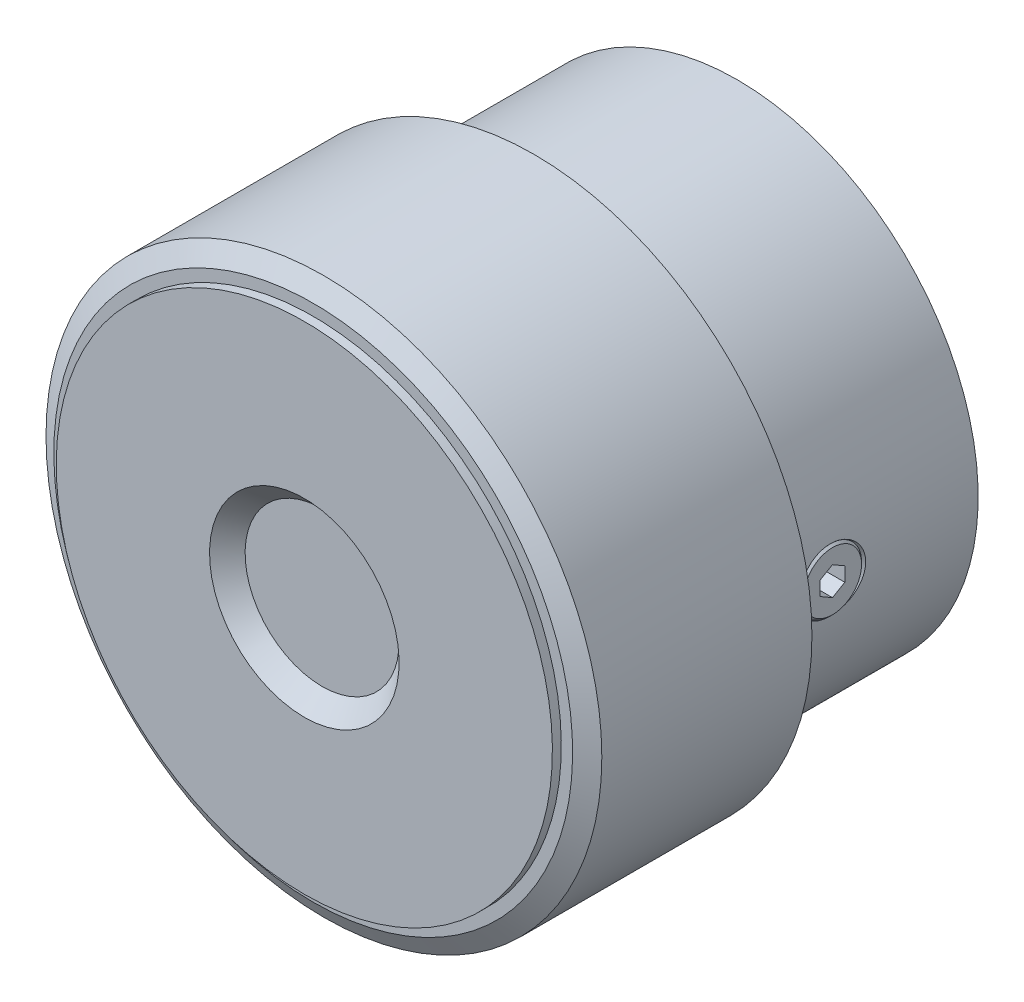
ISO-10303-21;
HEADER;
FILE_DESCRIPTION(('STEP AP214'),'2;1');
FILE_NAME('part.step','',(''),(''),'','','');
FILE_SCHEMA(('AUTOMOTIVE_DESIGN { 1 0 10303 214 1 1 1 1 }'));
ENDSEC;
DATA;
#1=APPLICATION_CONTEXT('core data for automotive mechanical design processes');
#2=APPLICATION_PROTOCOL_DEFINITION('international standard','automotive_design',2000,#1);
#3=PRODUCT_CONTEXT('',#1,'mechanical');
#4=PRODUCT('Part','Part','',(#3));
#5=PRODUCT_RELATED_PRODUCT_CATEGORY('part','',(#4));
#6=PRODUCT_DEFINITION_FORMATION('','',#4);
#7=PRODUCT_DEFINITION_CONTEXT('part definition',#1,'design');
#8=PRODUCT_DEFINITION('design','',#6,#7);
#9=PRODUCT_DEFINITION_SHAPE('','',#8);
#10=(LENGTH_UNIT() NAMED_UNIT(*) SI_UNIT(.MILLI.,.METRE.));
#11=(NAMED_UNIT(*) PLANE_ANGLE_UNIT() SI_UNIT($,.RADIAN.));
#12=(NAMED_UNIT(*) SI_UNIT($,.STERADIAN.) SOLID_ANGLE_UNIT());
#13=UNCERTAINTY_MEASURE_WITH_UNIT(LENGTH_MEASURE(1.E-05),#10,'distance_accuracy_value','');
#14=(GEOMETRIC_REPRESENTATION_CONTEXT(3) GLOBAL_UNCERTAINTY_ASSIGNED_CONTEXT((#13)) GLOBAL_UNIT_ASSIGNED_CONTEXT((#10,
#11,#12)) REPRESENTATION_CONTEXT('',''));
#15=CARTESIAN_POINT('',(0.,0.,0.));
#16=DIRECTION('',(0.,0.,1.));
#17=DIRECTION('',(1.,0.,0.));
#18=AXIS2_PLACEMENT_3D('',#15,#16,#17);
#19=CARTESIAN_POINT('',(0.,0.,13.4433756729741));
#20=DIRECTION('',(0.,0.,1.));
#21=DIRECTION('',(0.,-1.,0.));
#22=AXIS2_PLACEMENT_3D('',#19,#20,#21);
#23=CYLINDRICAL_SURFACE('',#22,2.5);
#24=CARTESIAN_POINT('',(0.,0.,12.));
#25=DIRECTION('',(0.,0.,-1.));
#26=DIRECTION('',(0.,1.,0.));
#27=AXIS2_PLACEMENT_3D('',#24,#25,#26);
#28=CIRCLE('',#27,2.5);
#29=CARTESIAN_POINT('',(0.,2.5,12.));
#30=VERTEX_POINT('',#29);
#31=EDGE_CURVE('E90',#30,#30,#28,.T.);
#32=ORIENTED_EDGE('',*,*,#31,.F.);
#33=EDGE_LOOP('',(#32));
#34=FACE_BOUND('',#33,.T.);
#35=CARTESIAN_POINT('',(0.,0.,0.2));
#36=DIRECTION('',(0.,0.,1.));
#37=DIRECTION('',(0.,-1.,0.));
#38=AXIS2_PLACEMENT_3D('',#35,#36,#37);
#39=CIRCLE('',#38,2.5);
#40=CARTESIAN_POINT('',(0.,-2.5,0.2));
#41=VERTEX_POINT('',#40);
#42=EDGE_CURVE('E137',#41,#41,#39,.T.);
#43=ORIENTED_EDGE('',*,*,#42,.F.);
#44=EDGE_LOOP('',(#43));
#45=FACE_BOUND('',#44,.T.);
#46=ADVANCED_FACE('F14',(#34,#45),#23,.F.);
#47=CARTESIAN_POINT('',(0.,0.,0.));
#48=DIRECTION('',(0.,0.,-1.));
#49=DIRECTION('',(0.,1.,0.));
#50=AXIS2_PLACEMENT_3D('',#47,#48,#49);
#51=CONICAL_SURFACE('',#50,2.7,0.785398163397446);
#52=ORIENTED_EDGE('',*,*,#42,.T.);
#53=EDGE_LOOP('',(#52));
#54=FACE_BOUND('',#53,.T.);
#55=CARTESIAN_POINT('',(0.,0.,0.));
#56=DIRECTION('',(0.,0.,1.));
#57=DIRECTION('',(0.,-1.,0.));
#58=AXIS2_PLACEMENT_3D('',#55,#56,#57);
#59=CIRCLE('',#58,2.7);
#60=CARTESIAN_POINT('',(0.,-2.7,0.));
#61=VERTEX_POINT('',#60);
#62=EDGE_CURVE('E140',#61,#61,#59,.T.);
#63=ORIENTED_EDGE('',*,*,#62,.F.);
#64=EDGE_LOOP('',(#63));
#65=FACE_BOUND('',#64,.T.);
#66=ADVANCED_FACE('F164',(#54,#65),#51,.F.);
#67=CARTESIAN_POINT('',(0.,0.,0.));
#68=DIRECTION('',(0.,0.,1.));
#69=DIRECTION('',(0.,-1.,0.));
#70=AXIS2_PLACEMENT_3D('',#67,#68,#69);
#71=PLANE('',#70);
#72=CARTESIAN_POINT('',(0.,0.,0.));
#73=DIRECTION('',(0.,0.,1.));
#74=DIRECTION('',(0.,-1.,0.));
#75=AXIS2_PLACEMENT_3D('',#72,#73,#74);
#76=CIRCLE('',#75,5.5);
#77=CARTESIAN_POINT('',(0.,-5.5,0.));
#78=VERTEX_POINT('',#77);
#79=EDGE_CURVE('E23',#78,#78,#76,.T.);
#80=ORIENTED_EDGE('',*,*,#79,.F.);
#81=EDGE_LOOP('',(#80));
#82=FACE_BOUND('',#81,.T.);
#83=ORIENTED_EDGE('',*,*,#62,.T.);
#84=EDGE_LOOP('',(#83));
#85=FACE_BOUND('',#84,.T.);
#86=ADVANCED_FACE('F215',(#82,#85),#71,.F.);
#87=CARTESIAN_POINT('',(11.,0.,8.5));
#88=DIRECTION('',(1.,0.,0.));
#89=DIRECTION('',(0.,1.,0.));
#90=AXIS2_PLACEMENT_3D('',#87,#88,#89);
#91=PLANE('',#90);
#92=DIRECTION('',(0.,1.,0.));
#93=VECTOR('',#92,1.);
#94=CARTESIAN_POINT('',(11.,-0.384900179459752,7.83333333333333));
#95=LINE('',#94,#93);
#96=CARTESIAN_POINT('',(11.,-0.384900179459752,7.83333333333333));
#97=VERTEX_POINT('',#96);
#98=CARTESIAN_POINT('',(11.,0.384900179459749,7.83333333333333));
#99=VERTEX_POINT('',#98);
#100=EDGE_CURVE('E71',#97,#99,#95,.T.);
#101=ORIENTED_EDGE('',*,*,#100,.T.);
#102=DIRECTION('',(0.,0.5,0.866025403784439));
#103=VECTOR('',#102,1.);
#104=CARTESIAN_POINT('',(11.,0.384900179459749,7.83333333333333));
#105=LINE('',#104,#103);
#106=CARTESIAN_POINT('',(11.,0.7698003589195,8.5));
#107=VERTEX_POINT('',#106);
#108=EDGE_CURVE('E78',#99,#107,#105,.T.);
#109=ORIENTED_EDGE('',*,*,#108,.T.);
#110=DIRECTION('',(0.,-0.5,0.866025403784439));
#111=VECTOR('',#110,1.);
#112=CARTESIAN_POINT('',(11.,0.7698003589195,8.5));
#113=LINE('',#112,#111);
#114=CARTESIAN_POINT('',(11.,0.384900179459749,9.16666666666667));
#115=VERTEX_POINT('',#114);
#116=EDGE_CURVE('E84',#107,#115,#113,.T.);
#117=ORIENTED_EDGE('',*,*,#116,.T.);
#118=DIRECTION('',(0.,-1.,0.));
#119=VECTOR('',#118,1.);
#120=CARTESIAN_POINT('',(11.,0.384900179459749,9.16666666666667));
#121=LINE('',#120,#119);
#122=CARTESIAN_POINT('',(11.,-0.384900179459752,9.16666666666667));
#123=VERTEX_POINT('',#122);
#124=EDGE_CURVE('E97',#115,#123,#121,.T.);
#125=ORIENTED_EDGE('',*,*,#124,.T.);
#126=DIRECTION('',(0.,-0.5,-0.866025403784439));
#127=VECTOR('',#126,1.);
#128=CARTESIAN_POINT('',(11.,-0.384900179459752,9.16666666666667));
#129=LINE('',#128,#127);
#130=CARTESIAN_POINT('',(11.,-0.769800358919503,8.5));
#131=VERTEX_POINT('',#130);
#132=EDGE_CURVE('E100',#123,#131,#129,.T.);
#133=ORIENTED_EDGE('',*,*,#132,.T.);
#134=DIRECTION('',(0.,0.5,-0.866025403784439));
#135=VECTOR('',#134,1.);
#136=CARTESIAN_POINT('',(11.,-0.769800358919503,8.5));
#137=LINE('',#136,#135);
#138=EDGE_CURVE('E89',#131,#97,#137,.T.);
#139=ORIENTED_EDGE('',*,*,#138,.T.);
#140=EDGE_LOOP('',(#101,#109,#117,#125,#133,#139));
#141=FACE_BOUND('',#140,.T.);
#142=ADVANCED_FACE('F87',(#141),#91,.T.);
#143=CARTESIAN_POINT('',(0.,0.,24.));
#144=DIRECTION('',(0.,0.,1.));
#145=DIRECTION('',(0.,-1.,0.));
#146=AXIS2_PLACEMENT_3D('',#143,#144,#145);
#147=CYLINDRICAL_SURFACE('',#146,5.5);
#148=CARTESIAN_POINT('',(0.,0.,0.3));
#149=DIRECTION('',(0.,0.,1.));
#150=DIRECTION('',(0.,-1.,0.));
#151=AXIS2_PLACEMENT_3D('',#148,#149,#150);
#152=CIRCLE('',#151,5.5);
#153=CARTESIAN_POINT('',(0.,-5.5,0.3));
#154=VERTEX_POINT('',#153);
#155=EDGE_CURVE('E508',#154,#154,#152,.T.);
#156=ORIENTED_EDGE('',*,*,#155,.F.);
#157=EDGE_LOOP('',(#156));
#158=FACE_BOUND('',#157,.T.);
#159=ORIENTED_EDGE('',*,*,#79,.T.);
#160=EDGE_LOOP('',(#159));
#161=FACE_BOUND('',#160,.T.);
#162=ADVANCED_FACE('F211',(#158,#161),#147,.T.);
#163=CARTESIAN_POINT('',(15.,0.384900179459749,7.83333333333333));
#164=DIRECTION('',(0.,-0.866025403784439,0.5));
#165=DIRECTION('',(0.,-0.5,-0.866025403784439));
#166=AXIS2_PLACEMENT_3D('',#163,#164,#165);
#167=PLANE('',#166);
#168=DIRECTION('',(0.,0.5,0.866025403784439));
#169=VECTOR('',#168,1.);
#170=CARTESIAN_POINT('',(13.005652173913,0.577350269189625,8.16666666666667));
#171=LINE('',#170,#169);
#172=CARTESIAN_POINT('',(13.005652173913,0.384900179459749,7.83333333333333));
#173=VERTEX_POINT('',#172);
#174=CARTESIAN_POINT('',(13.005652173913,0.7698003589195,8.5));
#175=VERTEX_POINT('',#174);
#176=EDGE_CURVE('E121',#173,#175,#171,.T.);
#177=ORIENTED_EDGE('',*,*,#176,.T.);
#178=DIRECTION('',(-1.,0.,0.));
#179=VECTOR('',#178,1.);
#180=CARTESIAN_POINT('',(15.,0.7698003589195,8.5));
#181=LINE('',#180,#179);
#182=EDGE_CURVE('E75',#175,#107,#181,.T.);
#183=ORIENTED_EDGE('',*,*,#182,.T.);
#184=ORIENTED_EDGE('',*,*,#108,.F.);
#185=DIRECTION('',(-1.,0.,0.));
#186=VECTOR('',#185,1.);
#187=CARTESIAN_POINT('',(15.,0.384900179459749,7.83333333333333));
#188=LINE('',#187,#186);
#189=EDGE_CURVE('E67',#173,#99,#188,.T.);
#190=ORIENTED_EDGE('',*,*,#189,.F.);
#191=EDGE_LOOP('',(#177,#183,#184,#190));
#192=FACE_BOUND('',#191,.T.);
#193=ADVANCED_FACE('F79',(#192),#167,.T.);
#194=CARTESIAN_POINT('',(15.,0.7698003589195,8.5));
#195=DIRECTION('',(0.,-0.866025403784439,-0.5));
#196=DIRECTION('',(0.,0.5,-0.866025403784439));
#197=AXIS2_PLACEMENT_3D('',#194,#195,#196);
#198=PLANE('',#197);
#199=DIRECTION('',(0.,-0.5,0.866025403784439));
#200=VECTOR('',#199,1.);
#201=CARTESIAN_POINT('',(13.005652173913,0.577350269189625,8.83333333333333));
#202=LINE('',#201,#200);
#203=CARTESIAN_POINT('',(13.005652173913,0.384900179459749,9.16666666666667));
#204=VERTEX_POINT('',#203);
#205=EDGE_CURVE('E119',#175,#204,#202,.T.);
#206=ORIENTED_EDGE('',*,*,#205,.T.);
#207=DIRECTION('',(-1.,0.,0.));
#208=VECTOR('',#207,1.);
#209=CARTESIAN_POINT('',(15.,0.384900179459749,9.16666666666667));
#210=LINE('',#209,#208);
#211=EDGE_CURVE('E108',#204,#115,#210,.T.);
#212=ORIENTED_EDGE('',*,*,#211,.T.);
#213=ORIENTED_EDGE('',*,*,#116,.F.);
#214=ORIENTED_EDGE('',*,*,#182,.F.);
#215=EDGE_LOOP('',(#206,#212,#213,#214));
#216=FACE_BOUND('',#215,.T.);
#217=ADVANCED_FACE('F220',(#216),#198,.T.);
#218=CARTESIAN_POINT('',(15.,0.384900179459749,9.16666666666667));
#219=DIRECTION('',(0.,0.,-1.));
#220=DIRECTION('',(0.,1.,0.));
#221=AXIS2_PLACEMENT_3D('',#218,#219,#220);
#222=PLANE('',#221);
#223=ORIENTED_EDGE('',*,*,#211,.F.);
#224=DIRECTION('',(0.,-1.,0.));
#225=VECTOR('',#224,1.);
#226=CARTESIAN_POINT('',(13.005652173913,0.,9.16666666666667));
#227=LINE('',#226,#225);
#228=CARTESIAN_POINT('',(13.005652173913,-0.384900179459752,9.16666666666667));
#229=VERTEX_POINT('',#228);
#230=EDGE_CURVE('E117',#204,#229,#227,.T.);
#231=ORIENTED_EDGE('',*,*,#230,.T.);
#232=DIRECTION('',(-1.,0.,0.));
#233=VECTOR('',#232,1.);
#234=CARTESIAN_POINT('',(15.,-0.384900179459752,9.16666666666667));
#235=LINE('',#234,#233);
#236=EDGE_CURVE('E106',#229,#123,#235,.T.);
#237=ORIENTED_EDGE('',*,*,#236,.T.);
#238=ORIENTED_EDGE('',*,*,#124,.F.);
#239=EDGE_LOOP('',(#223,#231,#237,#238));
#240=FACE_BOUND('',#239,.T.);
#241=ADVANCED_FACE('F242',(#240),#222,.T.);
#242=CARTESIAN_POINT('',(15.,-0.384900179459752,9.16666666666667));
#243=DIRECTION('',(0.,0.866025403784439,-0.5));
#244=DIRECTION('',(0.,0.5,0.866025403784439));
#245=AXIS2_PLACEMENT_3D('',#242,#243,#244);
#246=PLANE('',#245);
#247=DIRECTION('',(0.,-0.5,-0.866025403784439));
#248=VECTOR('',#247,1.);
#249=CARTESIAN_POINT('',(13.005652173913,-0.577350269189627,8.83333333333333));
#250=LINE('',#249,#248);
#251=CARTESIAN_POINT('',(13.005652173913,-0.769800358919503,8.5));
#252=VERTEX_POINT('',#251);
#253=EDGE_CURVE('E115',#229,#252,#250,.T.);
#254=ORIENTED_EDGE('',*,*,#253,.T.);
#255=DIRECTION('',(-1.,0.,0.));
#256=VECTOR('',#255,1.);
#257=CARTESIAN_POINT('',(15.,-0.769800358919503,8.5));
#258=LINE('',#257,#256);
#259=EDGE_CURVE('E31',#252,#131,#258,.T.);
#260=ORIENTED_EDGE('',*,*,#259,.T.);
#261=ORIENTED_EDGE('',*,*,#132,.F.);
#262=ORIENTED_EDGE('',*,*,#236,.F.);
#263=EDGE_LOOP('',(#254,#260,#261,#262));
#264=FACE_BOUND('',#263,.T.);
#265=ADVANCED_FACE('F239',(#264),#246,.T.);
#266=CARTESIAN_POINT('',(15.,-0.769800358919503,8.5));
#267=DIRECTION('',(0.,0.866025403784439,0.5));
#268=DIRECTION('',(0.,-0.5,0.866025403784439));
#269=AXIS2_PLACEMENT_3D('',#266,#267,#268);
#270=PLANE('',#269);
#271=DIRECTION('',(0.,0.5,-0.866025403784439));
#272=VECTOR('',#271,1.);
#273=CARTESIAN_POINT('',(13.005652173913,-0.577350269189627,8.16666666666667));
#274=LINE('',#273,#272);
#275=CARTESIAN_POINT('',(13.005652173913,-0.384900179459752,7.83333333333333));
#276=VERTEX_POINT('',#275);
#277=EDGE_CURVE('E113',#252,#276,#274,.T.);
#278=ORIENTED_EDGE('',*,*,#277,.T.);
#279=DIRECTION('',(-1.,0.,0.));
#280=VECTOR('',#279,1.);
#281=CARTESIAN_POINT('',(15.,-0.384900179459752,7.83333333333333));
#282=LINE('',#281,#280);
#283=EDGE_CURVE('E103',#276,#97,#282,.T.);
#284=ORIENTED_EDGE('',*,*,#283,.T.);
#285=ORIENTED_EDGE('',*,*,#138,.F.);
#286=ORIENTED_EDGE('',*,*,#259,.F.);
#287=EDGE_LOOP('',(#278,#284,#285,#286));
#288=FACE_BOUND('',#287,.T.);
#289=ADVANCED_FACE('F236',(#288),#270,.T.);
#290=CARTESIAN_POINT('',(15.,-0.384900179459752,7.83333333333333));
#291=DIRECTION('',(0.,0.,1.));
#292=DIRECTION('',(0.,-1.,0.));
#293=AXIS2_PLACEMENT_3D('',#290,#291,#292);
#294=PLANE('',#293);
#295=DIRECTION('',(0.,1.,0.));
#296=VECTOR('',#295,1.);
#297=CARTESIAN_POINT('',(13.005652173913,0.,7.83333333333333));
#298=LINE('',#297,#296);
#299=EDGE_CURVE('E18',#276,#173,#298,.T.);
#300=ORIENTED_EDGE('',*,*,#299,.T.);
#301=ORIENTED_EDGE('',*,*,#189,.T.);
#302=ORIENTED_EDGE('',*,*,#100,.F.);
#303=ORIENTED_EDGE('',*,*,#283,.F.);
#304=EDGE_LOOP('',(#300,#301,#302,#303));
#305=FACE_BOUND('',#304,.T.);
#306=ADVANCED_FACE('F69',(#305),#294,.T.);
#307=CARTESIAN_POINT('',(5.5,0.,0.3));
#308=DIRECTION('',(0.,0.,1.));
#309=DIRECTION('',(0.,-1.,0.));
#310=AXIS2_PLACEMENT_3D('',#307,#308,#309);
#311=PLANE('',#310);
#312=CARTESIAN_POINT('',(0.,0.,0.3));
#313=DIRECTION('',(0.,0.,1.));
#314=DIRECTION('',(0.,-1.,0.));
#315=AXIS2_PLACEMENT_3D('',#312,#313,#314);
#316=CIRCLE('',#315,6.);
#317=CARTESIAN_POINT('',(0.,-6.,0.3));
#318=VERTEX_POINT('',#317);
#319=EDGE_CURVE('E505',#318,#318,#316,.T.);
#320=ORIENTED_EDGE('',*,*,#319,.F.);
#321=EDGE_LOOP('',(#320));
#322=FACE_BOUND('',#321,.T.);
#323=ORIENTED_EDGE('',*,*,#155,.T.);
#324=EDGE_LOOP('',(#323));
#325=FACE_BOUND('',#324,.T.);
#326=ADVANCED_FACE('F195',(#322,#325),#311,.F.);
#327=CARTESIAN_POINT('',(13.005652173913,0.,8.5));
#328=DIRECTION('',(-1.,0.,0.));
#329=DIRECTION('',(0.,-1.,0.));
#330=AXIS2_PLACEMENT_3D('',#327,#328,#329);
#331=PLANE('',#330);
#332=CARTESIAN_POINT('',(13.005652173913,0.,8.5));
#333=DIRECTION('',(-1.,0.,0.));
#334=DIRECTION('',(0.,-1.,0.));
#335=AXIS2_PLACEMENT_3D('',#332,#333,#334);
#336=CIRCLE('',#335,1.5705);
#337=CARTESIAN_POINT('',(13.005652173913,-1.5705,8.5));
#338=VERTEX_POINT('',#337);
#339=EDGE_CURVE('E74',#338,#338,#336,.T.);
#340=ORIENTED_EDGE('',*,*,#339,.F.);
#341=EDGE_LOOP('',(#340));
#342=FACE_BOUND('',#341,.T.);
#343=ORIENTED_EDGE('',*,*,#299,.F.);
#344=ORIENTED_EDGE('',*,*,#277,.F.);
#345=ORIENTED_EDGE('',*,*,#253,.F.);
#346=ORIENTED_EDGE('',*,*,#230,.F.);
#347=ORIENTED_EDGE('',*,*,#205,.F.);
#348=ORIENTED_EDGE('',*,*,#176,.F.);
#349=EDGE_LOOP('',(#343,#344,#345,#346,#347,#348));
#350=FACE_BOUND('',#349,.T.);
#351=ADVANCED_FACE('F16',(#342,#350),#331,.F.);
#352=CARTESIAN_POINT('',(0.,0.,24.));
#353=DIRECTION('',(0.,0.,1.));
#354=DIRECTION('',(0.,-1.,0.));
#355=AXIS2_PLACEMENT_3D('',#352,#353,#354);
#356=CYLINDRICAL_SURFACE('',#355,6.);
#357=CARTESIAN_POINT('',(0.,0.,0.63));
#358=DIRECTION('',(0.,0.,1.));
#359=DIRECTION('',(0.,-1.,0.));
#360=AXIS2_PLACEMENT_3D('',#357,#358,#359);
#361=CIRCLE('',#360,6.);
#362=CARTESIAN_POINT('',(0.,-6.,0.63));
#363=VERTEX_POINT('',#362);
#364=EDGE_CURVE('E502',#363,#363,#361,.T.);
#365=ORIENTED_EDGE('',*,*,#364,.F.);
#366=EDGE_LOOP('',(#365));
#367=FACE_BOUND('',#366,.T.);
#368=ORIENTED_EDGE('',*,*,#319,.T.);
#369=EDGE_LOOP('',(#368));
#370=FACE_BOUND('',#369,.T.);
#371=ADVANCED_FACE('F194',(#367,#370),#356,.T.);
#372=CARTESIAN_POINT('',(13.005652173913,0.,8.5));
#373=DIRECTION('',(-1.,0.,0.));
#374=DIRECTION('',(0.,-1.,0.));
#375=AXIS2_PLACEMENT_3D('',#372,#373,#374);
#376=CONICAL_SURFACE('',#375,1.5705,0.785398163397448);
#377=CARTESIAN_POINT('',(12.8880760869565,0.,8.5));
#378=DIRECTION('',(-1.,0.,0.));
#379=DIRECTION('',(0.,-1.,0.));
#380=AXIS2_PLACEMENT_3D('',#377,#378,#379);
#381=CIRCLE('',#380,1.68807608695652);
#382=CARTESIAN_POINT('',(12.8880760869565,-1.68807608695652,8.5));
#383=VERTEX_POINT('',#382);
#384=EDGE_CURVE('E9',#383,#383,#381,.T.);
#385=ORIENTED_EDGE('',*,*,#384,.F.);
#386=EDGE_LOOP('',(#385));
#387=FACE_BOUND('',#386,.T.);
#388=ORIENTED_EDGE('',*,*,#339,.T.);
#389=EDGE_LOOP('',(#388));
#390=FACE_BOUND('',#389,.T.);
#391=ADVANCED_FACE('F209',(#387,#390),#376,.T.);
#392=CARTESIAN_POINT('',(6.,0.,0.63));
#393=DIRECTION('',(0.,0.,1.));
#394=DIRECTION('',(0.,-1.,0.));
#395=AXIS2_PLACEMENT_3D('',#392,#393,#394);
#396=PLANE('',#395);
#397=ORIENTED_EDGE('',*,*,#364,.T.);
#398=EDGE_LOOP('',(#397));
#399=FACE_BOUND('',#398,.T.);
#400=CARTESIAN_POINT('',(0.,0.,0.63));
#401=DIRECTION('',(0.,0.,1.));
#402=DIRECTION('',(0.,-1.,0.));
#403=AXIS2_PLACEMENT_3D('',#400,#401,#402);
#404=CIRCLE('',#403,13.);
#405=CARTESIAN_POINT('',(0.,-13.,0.63));
#406=VERTEX_POINT('',#405);
#407=EDGE_CURVE('E499',#406,#406,#404,.T.);
#408=ORIENTED_EDGE('',*,*,#407,.F.);
#409=EDGE_LOOP('',(#408));
#410=FACE_BOUND('',#409,.T.);
#411=ADVANCED_FACE('F162',(#399,#410),#396,.F.);
#412=CARTESIAN_POINT('',(13.2,0.,8.5));
#413=DIRECTION('',(1.,0.,0.));
#414=DIRECTION('',(0.,0.,-1.));
#415=AXIS2_PLACEMENT_3D('',#412,#413,#414);
#416=CONICAL_SURFACE('',#415,2.,0.78539816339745);
#417=CARTESIAN_POINT('',(12.9431972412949,-1.2139378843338,7.24896385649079));
#418=CARTESIAN_POINT('',(12.9486321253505,-1.15598715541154,7.18515845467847));
#419=CARTESIAN_POINT('',(12.95411531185,-1.09333814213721,7.12561511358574));
#420=CARTESIAN_POINT('',(12.9646981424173,-0.959734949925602,7.01659920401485));
#421=CARTESIAN_POINT('',(12.9697976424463,-0.888777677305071,6.96713040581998));
#422=CARTESIAN_POINT('',(12.9796922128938,-0.731114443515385,6.8745582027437));
#423=CARTESIAN_POINT('',(12.9843791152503,-0.643539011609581,6.83290954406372));
#424=CARTESIAN_POINT('',(12.9920939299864,-0.462285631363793,6.76586842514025));
#425=CARTESIAN_POINT('',(12.9951219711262,-0.368608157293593,6.74047470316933));
#426=CARTESIAN_POINT('',(12.9990116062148,-0.183704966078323,6.70807803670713));
#427=CARTESIAN_POINT('',(12.9999889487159,-0.0926534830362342,6.700091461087));
#428=CARTESIAN_POINT('',(13.0000108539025,0.089449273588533,6.69991016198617));
#429=CARTESIAN_POINT('',(12.9990559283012,0.180500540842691,6.70771125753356));
#430=CARTESIAN_POINT('',(12.9953821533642,0.357267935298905,6.73830549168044));
#431=CARTESIAN_POINT('',(12.9927152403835,0.443062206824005,6.76065747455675));
#432=CARTESIAN_POINT('',(12.9859588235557,0.609788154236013,6.81904806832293));
#433=CARTESIAN_POINT('',(12.9818691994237,0.690719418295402,6.85508783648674));
#434=CARTESIAN_POINT('',(12.9725844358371,0.84757191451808,6.94057061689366));
#435=CARTESIAN_POINT('',(12.9673654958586,0.923329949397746,6.99030972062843));
#436=CARTESIAN_POINT('',(12.9564197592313,1.06598100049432,7.10113316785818));
#437=CARTESIAN_POINT('',(12.9506928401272,1.13287186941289,7.16222025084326));
#438=CARTESIAN_POINT('',(12.9389544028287,1.2600718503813,7.29780227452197));
#439=CARTESIAN_POINT('',(12.9329457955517,1.31976847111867,7.37287188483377));
#440=CARTESIAN_POINT('',(12.9216017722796,1.42656910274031,7.53153062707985));
#441=CARTESIAN_POINT('',(12.9162665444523,1.47366959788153,7.61512212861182));
#442=CARTESIAN_POINT('',(12.9065129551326,1.55685279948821,7.79384493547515));
#443=CARTESIAN_POINT('',(12.902168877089,1.59210418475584,7.88936776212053));
#444=CARTESIAN_POINT('',(12.8952989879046,1.64682337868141,8.08489536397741));
#445=CARTESIAN_POINT('',(12.8927735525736,1.66628792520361,8.18490106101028));
#446=CARTESIAN_POINT('',(12.8897539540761,1.68949455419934,8.39056335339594));
#447=CARTESIAN_POINT('',(12.8893395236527,1.69261960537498,8.49629121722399));
#448=CARTESIAN_POINT('',(12.8908053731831,1.68141790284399,8.70681077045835));
#449=CARTESIAN_POINT('',(12.8926859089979,1.6670892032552,8.81160235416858));
#450=CARTESIAN_POINT('',(12.8985577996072,1.62103305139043,9.01832956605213));
#451=CARTESIAN_POINT('',(12.9025698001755,1.58913530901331,9.1202268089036));
#452=CARTESIAN_POINT('',(12.9122474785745,1.50847810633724,9.31705123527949));
#453=CARTESIAN_POINT('',(12.9179131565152,1.45971864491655,9.41197841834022));
#454=CARTESIAN_POINT('',(12.9301074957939,1.34738479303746,9.59027531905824));
#455=CARTESIAN_POINT('',(12.9366194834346,1.28408204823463,9.67381694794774));
#456=CARTESIAN_POINT('',(12.9497856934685,1.14367968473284,9.82838089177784));
#457=CARTESIAN_POINT('',(12.9564398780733,1.06658369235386,9.89940648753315));
#458=CARTESIAN_POINT('',(12.9687264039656,0.904652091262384,10.023101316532));
#459=CARTESIAN_POINT('',(12.9743926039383,0.820371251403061,10.0764922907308));
#460=CARTESIAN_POINT('',(12.9843644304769,0.64350485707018,10.1672429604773));
#461=CARTESIAN_POINT('',(12.9886707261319,0.550923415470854,10.2046105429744));
#462=CARTESIAN_POINT('',(12.9951321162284,0.366698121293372,10.2597300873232));
#463=CARTESIAN_POINT('',(12.9974106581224,0.275397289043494,10.2786160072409));
#464=CARTESIAN_POINT('',(13.0000092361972,0.0908797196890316,10.3001087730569));
#465=CARTESIAN_POINT('',(13.0003298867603,-0.00233640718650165,10.3027207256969));
#466=CARTESIAN_POINT('',(12.9990054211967,-0.183619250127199,10.2918100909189));
#467=CARTESIAN_POINT('',(12.9974471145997,-0.271730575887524,10.2790000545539));
#468=CARTESIAN_POINT('',(12.9926844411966,-0.444552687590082,10.2389514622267));
#469=CARTESIAN_POINT('',(12.9894800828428,-0.52926349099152,10.2117129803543));
#470=CARTESIAN_POINT('',(12.9817461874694,-0.693604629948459,10.1436187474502));
#471=CARTESIAN_POINT('',(12.9772078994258,-0.773197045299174,10.1026728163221));
#472=CARTESIAN_POINT('',(12.9672876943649,-0.924786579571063,10.0086453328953));
#473=CARTESIAN_POINT('',(12.9619056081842,-0.996782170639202,9.95556134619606));
#474=CARTESIAN_POINT('',(12.9505479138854,-1.13506323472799,9.83595881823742));
#475=CARTESIAN_POINT('',(12.9445560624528,-1.20087773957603,9.76889783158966));
#476=CARTESIAN_POINT('',(12.9328387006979,-1.32111359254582,9.62522707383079));
#477=CARTESIAN_POINT('',(12.9271132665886,-1.37553169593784,9.54861459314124));
#478=CARTESIAN_POINT('',(12.9161522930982,-1.47501837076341,9.38282948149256));
#479=CARTESIAN_POINT('',(12.9109703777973,-1.51928144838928,9.29316954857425));
#480=CARTESIAN_POINT('',(12.9020876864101,-1.59295783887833,9.10787719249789));
#481=CARTESIAN_POINT('',(12.8983872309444,-1.62236793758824,9.01224348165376));
#482=CARTESIAN_POINT('',(12.8927224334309,-1.66680583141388,8.81297257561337));
#483=CARTESIAN_POINT('',(12.8908463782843,-1.68110490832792,8.70916981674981));
#484=CARTESIAN_POINT('',(12.8893456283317,-1.69257262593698,8.50058694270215));
#485=CARTESIAN_POINT('',(12.889721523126,-1.68973678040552,8.39580657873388));
#486=CARTESIAN_POINT('',(12.8927120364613,-1.66676732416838,8.18617317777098));
#487=CARTESIAN_POINT('',(12.8953689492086,-1.64630689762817,8.08135639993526));
#488=CARTESIAN_POINT('',(12.9026710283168,-1.58806063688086,7.87674996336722));
#489=CARTESIAN_POINT('',(12.9073151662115,-1.55028376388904,7.77695773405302));
#490=CARTESIAN_POINT('',(12.9170722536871,-1.46651756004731,7.60264189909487));
#491=CARTESIAN_POINT('',(12.9219511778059,-1.4232219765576,7.52679908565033));
#492=CARTESIAN_POINT('',(12.9322695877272,-1.32619043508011,7.3821790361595));
#493=CARTESIAN_POINT('',(12.9377087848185,-1.27245984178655,7.31339819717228));
#494=CARTESIAN_POINT('',(12.9431972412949,-1.2139378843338,7.24896385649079));
#495=B_SPLINE_CURVE_WITH_KNOTS('',3,(#417,#418,#419,#420,#421,#422,#423,#424,#425,#426,#427,
#428,#429,#430,#431,#432,#433,#434,#435,#436,#437,#438,#439,#440,#441,#442,#443,#444,#445,#446,
#447,#448,#449,#450,#451,#452,#453,#454,#455,#456,#457,#458,#459,#460,#461,#462,#463,#464,#465,
#466,#467,#468,#469,#470,#471,#472,#473,#474,#475,#476,#477,#478,#479,#480,#481,#482,#483,#484,
#485,#486,#487,#488,#489,#490,#491,#492,#493,#494),.UNSPECIFIED.,.T.,.F.,(4,2,2,2,2,2,2,2,2,2,2,
2,2,2,2,2,2,2,2,2,2,2,2,2,2,2,2,2,2,2,2,2,2,2,2,2,2,2,4),(0.,0.258856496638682,
0.517809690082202,0.807531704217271,1.0972312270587,1.37008332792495,1.64286318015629,
1.90773549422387,2.17263020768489,2.44377298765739,2.71498130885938,3.00202784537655,
3.28915441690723,3.59352050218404,3.89794946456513,4.21379569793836,4.52967714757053,
4.84867561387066,5.16767410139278,5.48113933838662,5.79452228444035,6.09274637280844,
6.39082350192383,6.66918488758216,6.94745891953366,7.21335437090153,7.47924845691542,
7.74692738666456,8.01466004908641,8.29589258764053,8.57720508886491,8.87624874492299,
9.17535708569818,9.4883101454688,9.80134514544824,10.1203129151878,10.4391158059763,
10.7006579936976,10.9620660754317),.UNSPECIFIED.);
#496=CARTESIAN_POINT('',(12.9431972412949,-1.2139378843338,7.24896385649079));
#497=VERTEX_POINT('',#496);
#498=EDGE_CURVE('E143',#497,#497,#495,.T.);
#499=ORIENTED_EDGE('',*,*,#498,.T.);
#500=EDGE_LOOP('',(#499));
#501=FACE_BOUND('',#500,.T.);
#502=ORIENTED_EDGE('',*,*,#384,.T.);
#503=EDGE_LOOP('',(#502));
#504=FACE_BOUND('',#503,.T.);
#505=ADVANCED_FACE('F157',(#501,#504),#416,.F.);
#506=CARTESIAN_POINT('',(0.,0.,24.));
#507=DIRECTION('',(0.,0.,1.));
#508=DIRECTION('',(0.,-1.,0.));
#509=AXIS2_PLACEMENT_3D('',#506,#507,#508);
#510=CYLINDRICAL_SURFACE('',#509,13.);
#511=CARTESIAN_POINT('',(0.,0.,10.5));
#512=DIRECTION('',(0.,0.,1.));
#513=DIRECTION('',(0.,-1.,0.));
#514=AXIS2_PLACEMENT_3D('',#511,#512,#513);
#515=CIRCLE('',#514,13.);
#516=CARTESIAN_POINT('',(0.,-13.,10.5));
#517=VERTEX_POINT('',#516);
#518=EDGE_CURVE('E496',#517,#517,#515,.T.);
#519=ORIENTED_EDGE('',*,*,#518,.F.);
#520=EDGE_LOOP('',(#519));
#521=FACE_BOUND('',#520,.T.);
#522=ORIENTED_EDGE('',*,*,#498,.F.);
#523=EDGE_LOOP('',(#522));
#524=FACE_BOUND('',#523,.T.);
#525=ORIENTED_EDGE('',*,*,#407,.T.);
#526=EDGE_LOOP('',(#525));
#527=FACE_BOUND('',#526,.T.);
#528=ADVANCED_FACE('F153',(#521,#524,#527),#510,.T.);
#529=CARTESIAN_POINT('',(13.,0.,10.5));
#530=DIRECTION('',(0.,0.,1.));
#531=DIRECTION('',(0.,-1.,0.));
#532=AXIS2_PLACEMENT_3D('',#529,#530,#531);
#533=PLANE('',#532);
#534=CARTESIAN_POINT('',(0.,0.,10.5));
#535=DIRECTION('',(0.,0.,1.));
#536=DIRECTION('',(0.,-1.,0.));
#537=AXIS2_PLACEMENT_3D('',#534,#535,#536);
#538=CIRCLE('',#537,13.39);
#539=CARTESIAN_POINT('',(0.,-13.39,10.5));
#540=VERTEX_POINT('',#539);
#541=EDGE_CURVE('E493',#540,#540,#538,.T.);
#542=ORIENTED_EDGE('',*,*,#541,.F.);
#543=EDGE_LOOP('',(#542));
#544=FACE_BOUND('',#543,.T.);
#545=ORIENTED_EDGE('',*,*,#518,.T.);
#546=EDGE_LOOP('',(#545));
#547=FACE_BOUND('',#546,.T.);
#548=ADVANCED_FACE('F197',(#544,#547),#533,.F.);
#549=CARTESIAN_POINT('',(0.,0.,24.));
#550=DIRECTION('',(0.,0.,1.));
#551=DIRECTION('',(0.,-1.,0.));
#552=AXIS2_PLACEMENT_3D('',#549,#550,#551);
#553=CYLINDRICAL_SURFACE('',#552,13.39);
#554=CARTESIAN_POINT('',(0.,0.,11.025));
#555=DIRECTION('',(0.,0.,1.));
#556=DIRECTION('',(0.,-1.,0.));
#557=AXIS2_PLACEMENT_3D('',#554,#555,#556);
#558=CIRCLE('',#557,13.39);
#559=CARTESIAN_POINT('',(0.,-13.39,11.025));
#560=VERTEX_POINT('',#559);
#561=EDGE_CURVE('E490',#560,#560,#558,.T.);
#562=ORIENTED_EDGE('',*,*,#561,.F.);
#563=EDGE_LOOP('',(#562));
#564=FACE_BOUND('',#563,.T.);
#565=ORIENTED_EDGE('',*,*,#541,.T.);
#566=EDGE_LOOP('',(#565));
#567=FACE_BOUND('',#566,.T.);
#568=ADVANCED_FACE('F192',(#564,#567),#553,.T.);
#569=CARTESIAN_POINT('',(13.39,0.,11.025));
#570=DIRECTION('',(0.,0.,1.));
#571=DIRECTION('',(0.,-1.,0.));
#572=AXIS2_PLACEMENT_3D('',#569,#570,#571);
#573=PLANE('',#572);
#574=CARTESIAN_POINT('',(0.,0.,11.025));
#575=DIRECTION('',(0.,0.,1.));
#576=DIRECTION('',(0.,-1.,0.));
#577=AXIS2_PLACEMENT_3D('',#574,#575,#576);
#578=CIRCLE('',#577,14.);
#579=CARTESIAN_POINT('',(0.,-14.,11.025));
#580=VERTEX_POINT('',#579);
#581=EDGE_CURVE('E124',#580,#580,#578,.T.);
#582=ORIENTED_EDGE('',*,*,#581,.F.);
#583=EDGE_LOOP('',(#582));
#584=FACE_BOUND('',#583,.T.);
#585=ORIENTED_EDGE('',*,*,#561,.T.);
#586=EDGE_LOOP('',(#585));
#587=FACE_BOUND('',#586,.T.);
#588=ADVANCED_FACE('F188',(#584,#587),#573,.F.);
#589=CARTESIAN_POINT('',(0.,0.,11.025));
#590=DIRECTION('',(0.,0.,1.));
#591=DIRECTION('',(0.,-1.,0.));
#592=AXIS2_PLACEMENT_3D('',#589,#590,#591);
#593=CONICAL_SURFACE('',#592,14.,1.0471975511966);
#594=CARTESIAN_POINT('',(0.,0.,11.6023502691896));
#595=DIRECTION('',(0.,0.,1.));
#596=DIRECTION('',(0.,-1.,0.));
#597=AXIS2_PLACEMENT_3D('',#594,#595,#596);
#598=CIRCLE('',#597,15.);
#599=CARTESIAN_POINT('',(0.,-15.,11.6023502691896));
#600=VERTEX_POINT('',#599);
#601=EDGE_CURVE('E134',#600,#600,#598,.T.);
#602=ORIENTED_EDGE('',*,*,#601,.F.);
#603=EDGE_LOOP('',(#602));
#604=FACE_BOUND('',#603,.T.);
#605=ORIENTED_EDGE('',*,*,#581,.T.);
#606=EDGE_LOOP('',(#605));
#607=FACE_BOUND('',#606,.T.);
#608=ADVANCED_FACE('F191',(#604,#607),#593,.T.);
#609=CARTESIAN_POINT('',(0.,0.,12.));
#610=DIRECTION('',(0.,0.,-1.));
#611=DIRECTION('',(0.,1.,0.));
#612=AXIS2_PLACEMENT_3D('',#609,#610,#611);
#613=PLANE('',#612);
#614=ORIENTED_EDGE('',*,*,#31,.T.);
#615=EDGE_LOOP('',(#614));
#616=FACE_BOUND('',#615,.T.);
#617=ADVANCED_FACE('F253',(#616),#613,.T.);
#618=CARTESIAN_POINT('',(4.11627906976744,0.,23.04));
#619=DIRECTION('',(0.,0.,-1.));
#620=DIRECTION('',(0.,1.,0.));
#621=AXIS2_PLACEMENT_3D('',#618,#619,#620);
#622=PLANE('',#621);
#623=CARTESIAN_POINT('',(0.,0.,23.04));
#624=DIRECTION('',(0.,0.,1.));
#625=DIRECTION('',(0.,-1.,0.));
#626=AXIS2_PLACEMENT_3D('',#623,#624,#625);
#627=CIRCLE('',#626,4.15627906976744);
#628=CARTESIAN_POINT('',(0.,-4.15627906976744,23.04));
#629=VERTEX_POINT('',#628);
#630=EDGE_CURVE('E151',#629,#629,#627,.T.);
#631=ORIENTED_EDGE('',*,*,#630,.T.);
#632=EDGE_LOOP('',(#631));
#633=FACE_BOUND('',#632,.T.);
#634=ADVANCED_FACE('F170',(#633),#622,.F.);
#635=CARTESIAN_POINT('',(0.,0.,24.));
#636=DIRECTION('',(0.,0.,1.));
#637=DIRECTION('',(0.,-1.,0.));
#638=AXIS2_PLACEMENT_3D('',#635,#636,#637);
#639=CONICAL_SURFACE('',#638,5.11627906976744,0.785398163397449);
#640=ORIENTED_EDGE('',*,*,#630,.F.);
#641=EDGE_LOOP('',(#640));
#642=FACE_BOUND('',#641,.T.);
#643=CARTESIAN_POINT('',(0.,0.,24.));
#644=DIRECTION('',(0.,0.,1.));
#645=DIRECTION('',(0.,-1.,0.));
#646=AXIS2_PLACEMENT_3D('',#643,#644,#645);
#647=CIRCLE('',#646,5.11627906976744);
#648=CARTESIAN_POINT('',(0.,-5.11627906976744,24.));
#649=VERTEX_POINT('',#648);
#650=EDGE_CURVE('E479',#649,#649,#647,.T.);
#651=ORIENTED_EDGE('',*,*,#650,.T.);
#652=EDGE_LOOP('',(#651));
#653=FACE_BOUND('',#652,.T.);
#654=ADVANCED_FACE('F166',(#642,#653),#639,.F.);
#655=CARTESIAN_POINT('',(13.39,0.,24.));
#656=DIRECTION('',(0.,0.,-1.));
#657=DIRECTION('',(0.,1.,0.));
#658=AXIS2_PLACEMENT_3D('',#655,#656,#657);
#659=PLANE('',#658);
#660=ORIENTED_EDGE('',*,*,#650,.F.);
#661=EDGE_LOOP('',(#660));
#662=FACE_BOUND('',#661,.T.);
#663=CARTESIAN_POINT('',(0.,0.,24.));
#664=DIRECTION('',(0.,0.,1.));
#665=DIRECTION('',(0.,-1.,0.));
#666=AXIS2_PLACEMENT_3D('',#663,#664,#665);
#667=CIRCLE('',#666,13.39);
#668=CARTESIAN_POINT('',(0.,-13.39,24.));
#669=VERTEX_POINT('',#668);
#670=EDGE_CURVE('E481',#669,#669,#667,.T.);
#671=ORIENTED_EDGE('',*,*,#670,.T.);
#672=EDGE_LOOP('',(#671));
#673=FACE_BOUND('',#672,.T.);
#674=ADVANCED_FACE('F169',(#662,#673),#659,.F.);
#675=CARTESIAN_POINT('',(0.,0.,24.));
#676=DIRECTION('',(0.,0.,1.));
#677=DIRECTION('',(0.,-1.,0.));
#678=AXIS2_PLACEMENT_3D('',#675,#676,#677);
#679=CYLINDRICAL_SURFACE('',#678,13.39);
#680=ORIENTED_EDGE('',*,*,#670,.F.);
#681=EDGE_LOOP('',(#680));
#682=FACE_BOUND('',#681,.T.);
#683=CARTESIAN_POINT('',(0.,0.,23.52));
#684=DIRECTION('',(0.,0.,1.));
#685=DIRECTION('',(0.,-1.,0.));
#686=AXIS2_PLACEMENT_3D('',#683,#684,#685);
#687=CIRCLE('',#686,13.39);
#688=CARTESIAN_POINT('',(0.,-13.39,23.52));
#689=VERTEX_POINT('',#688);
#690=EDGE_CURVE('E485',#689,#689,#687,.T.);
#691=ORIENTED_EDGE('',*,*,#690,.T.);
#692=EDGE_LOOP('',(#691));
#693=FACE_BOUND('',#692,.T.);
#694=ADVANCED_FACE('F174',(#682,#693),#679,.T.);
#695=CARTESIAN_POINT('',(0.,0.,24.));
#696=DIRECTION('',(0.,0.,1.));
#697=DIRECTION('',(0.,-1.,0.));
#698=AXIS2_PLACEMENT_3D('',#695,#696,#697);
#699=CYLINDRICAL_SURFACE('',#698,15.);
#700=ORIENTED_EDGE('',*,*,#601,.T.);
#701=EDGE_LOOP('',(#700));
#702=FACE_BOUND('',#701,.T.);
#703=CARTESIAN_POINT('',(0.,0.,22.9426497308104));
#704=DIRECTION('',(0.,0.,-1.));
#705=DIRECTION('',(0.,1.,0.));
#706=AXIS2_PLACEMENT_3D('',#703,#704,#705);
#707=CIRCLE('',#706,15.);
#708=CARTESIAN_POINT('',(0.,15.,22.9426497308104));
#709=VERTEX_POINT('',#708);
#710=EDGE_CURVE('E129',#709,#709,#707,.T.);
#711=ORIENTED_EDGE('',*,*,#710,.T.);
#712=EDGE_LOOP('',(#711));
#713=FACE_BOUND('',#712,.T.);
#714=ADVANCED_FACE('F178',(#702,#713),#699,.T.);
#715=CARTESIAN_POINT('',(0.,0.,22.3652994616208));
#716=DIRECTION('',(0.,0.,-1.));
#717=DIRECTION('',(0.,1.,0.));
#718=AXIS2_PLACEMENT_3D('',#715,#716,#717);
#719=CONICAL_SURFACE('',#718,16.,1.0471975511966);
#720=CARTESIAN_POINT('',(0.,0.,23.52));
#721=DIRECTION('',(0.,0.,1.));
#722=DIRECTION('',(0.,-1.,0.));
#723=AXIS2_PLACEMENT_3D('',#720,#721,#722);
#724=CIRCLE('',#723,14.);
#725=CARTESIAN_POINT('',(0.,-14.,23.52));
#726=VERTEX_POINT('',#725);
#727=EDGE_CURVE('E122',#726,#726,#724,.T.);
#728=ORIENTED_EDGE('',*,*,#727,.F.);
#729=EDGE_LOOP('',(#728));
#730=FACE_BOUND('',#729,.T.);
#731=ORIENTED_EDGE('',*,*,#710,.F.);
#732=EDGE_LOOP('',(#731));
#733=FACE_BOUND('',#732,.T.);
#734=ADVANCED_FACE('F183',(#730,#733),#719,.T.);
#735=CARTESIAN_POINT('',(14.8,0.,23.52));
#736=DIRECTION('',(0.,0.,-1.));
#737=DIRECTION('',(0.,1.,0.));
#738=AXIS2_PLACEMENT_3D('',#735,#736,#737);
#739=PLANE('',#738);
#740=ORIENTED_EDGE('',*,*,#690,.F.);
#741=EDGE_LOOP('',(#740));
#742=FACE_BOUND('',#741,.T.);
#743=ORIENTED_EDGE('',*,*,#727,.T.);
#744=EDGE_LOOP('',(#743));
#745=FACE_BOUND('',#744,.T.);
#746=ADVANCED_FACE('F180',(#742,#745),#739,.F.);
#747=CLOSED_SHELL('',(#46,#66,#86,#142,#162,#193,#217,#241,#265,#289,#306,#326,#351,#371,#391,
#411,#505,#528,#548,#568,#588,#608,#617,#634,#654,#674,#694,#714,#734,#746));
#748=MANIFOLD_SOLID_BREP('B1',#747);
#749=ADVANCED_BREP_SHAPE_REPRESENTATION('',(#18,#748),#14);
#750=SHAPE_DEFINITION_REPRESENTATION(#9,#749);
ENDSEC;
END-ISO-10303-21;
